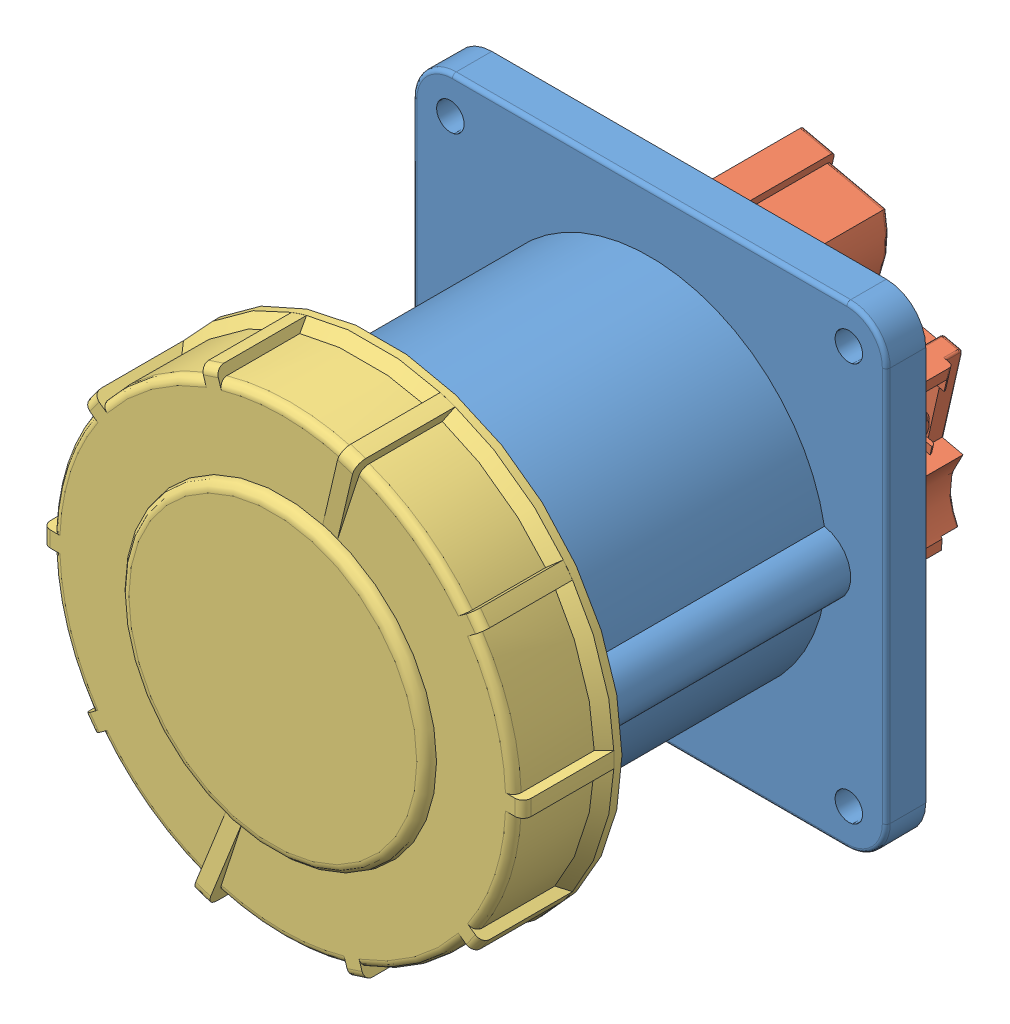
SolidWorks assembly Сборка 3452.SLDASM, configuration По умолчанию (file format 10000). Lengths in mm.
Overall size (126.06 122 152).
3 component instances, 3 part files, 5 mates.
Components (placement in the parent):
- Корпус 3442,3452-1: Корпус 3442,3452.SLDPRT [По умолчанию] at (61.1718 69.6353 45.1989) size (125 120 90)
- Колодка 3452,4452-1: Колодка 3452,4452.SLDPRT [По умолчанию] at (61.1718 69.6353 43.1989) x (0.955113 0.296242 0) z (0 0 -1) size (83 83 129.5)
- Крышка 4442,4452,3442,3452-1: Крышка 4442,4452,3442,3452.SLDPRT [По умолчанию] at (61.1718 69.6353 146.1989) x (1 0 0) z (0 0 -1) size (126.06 122 45.5)
Mates (geometry in assembly coordinates):
- Концентричный1: concentric: cylinder of Корпус 3442,3452-1 through (61.1718 69.6353 47.6989) axis (0 0 -1) radius 37.8721; cylinder of Колодка 3452,4452-1 through (61.1718 69.6353 126.1989) axis (0 0 -1) radius 35
- Совпадение1: coincident anti-aligned: plane of Корпус 3442,3452-1 through (61.1718 69.6353 43.1989) normal (0 0 -1); plane of Колодка 3452,4452-1 through (61.1718 69.6353 43.1989) normal (0 0 1)
- Концентричный2: concentric: cylinder of Корпус 3442,3452-1 through (61.1718 69.6353 133.1989) axis (0 0 -1) radius 45; cylinder of Крышка 4442,4452,3442,3452-1 through (61.1718 69.6353 133.1989) axis (0 0 -1) radius 55
- Совпадение2: coincident: plane of Корпус 3442,3452-1 through (61.1718 69.6353 133.1989) normal (0 0 1); plane of Крышка 4442,4452,3442,3452-1 through (61.1718 69.6353 133.1989) normal (0 0 -1)
- Параллельность1: parallel anti-aligned: plane of Корпус 3442,3452-1 through (-7.7067 58.1353 88.1989) normal (0 1 0); plane of Крышка 4442,4452,3442,3452-1 through (3.1718 58.6353 110.1989) normal (0 -1 0)
